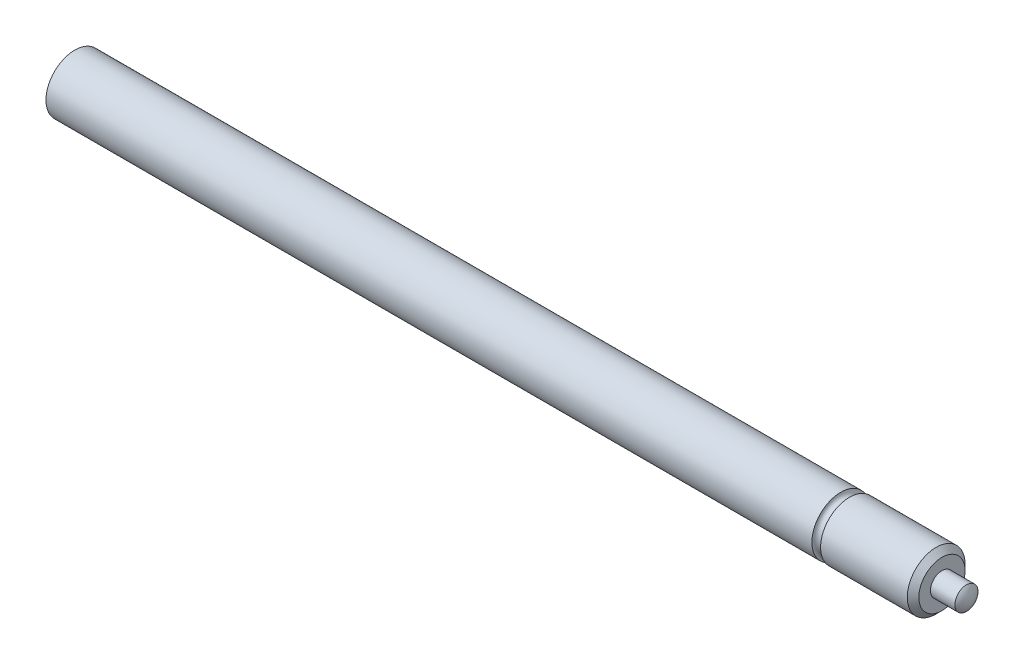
from build123d import *

# Parameters (mm, degrees)
ESQUISSE1_R        = 5
BOSS_EXTRU_1_DEPTH = 150
CHANFREIN1_SIZE    = 1
ESQUISSE3_R        = 2
BOSS_EXTRU_2_DEPTH = 5


with BuildPart() as part:
    # Esquisse1 → Boss.-Extru.1 (new body)
    with BuildSketch(Plane(origin=(0, 0, 0), x_dir=(0, 0, -1), z_dir=(1, 0, 0))):
        Circle(ESQUISSE1_R)
    extrude(amount=BOSS_EXTRU_1_DEPTH)

    # Chanfrein1
    chanfrein1_edges = [part.edges().sort_by_distance(p)[0] for p in [
        (150, 0, 5),
    ]]
    chamfer(chanfrein1_edges, length=CHANFREIN1_SIZE)

    # Esquisse2 → Enl_vement de mati_re-R_volution1 (revolve, cut)
    with BuildSketch(Plane.XY, mode=Mode.PRIVATE) as enl_vement_de_mati_re_r_volution1_sk:
        with BuildLine():
            Line((132.5, 5), (134, 5))
            ThreePointArc((134, 5), (133.25, 4.25), (132.5, 5))
        make_face()
    revolve(enl_vement_de_mati_re_r_volution1_sk.sketch.rotate(Axis((152.095586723, 0, 0), (-1, 0, 0)), 90), axis=Axis((152.095586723, 0, 0), (-1, 0, 0)), mode=Mode.SUBTRACT)

    # Esquisse3 → Boss.-Extru.2 (add)
    with BuildSketch(Plane(origin=(150, 0, 0), x_dir=(0, 0, -1), z_dir=(1, 0, 0))):
        Circle(ESQUISSE3_R)
    extrude(amount=BOSS_EXTRU_2_DEPTH)

    # Esquisse4 → Enl_vement de mati_re-R_volution2 (revolve, cut)
    with BuildSketch(Plane.XY, mode=Mode.PRIVATE) as enl_vement_de_mati_re_r_volution2_sk:
        with BuildLine():
            Line((154.236067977, 2), (154.236067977, 3))
            Line((154.236067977, 3), (156.236067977, 3))
            Line((156.236067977, 3), (156.236067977, 0))
            Line((156.236067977, 0), (155, 0))
            ThreePointArc((155, 0), (154.802517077, 1.070466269), (154.236067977, 2))
        make_face()
    revolve(enl_vement_de_mati_re_r_volution2_sk.sketch.rotate(Axis((158.089360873, 0, 0), (-1, 0, 0)), 90), axis=Axis((158.089360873, 0, 0), (-1, 0, 0)), mode=Mode.SUBTRACT)


solid = part.part
